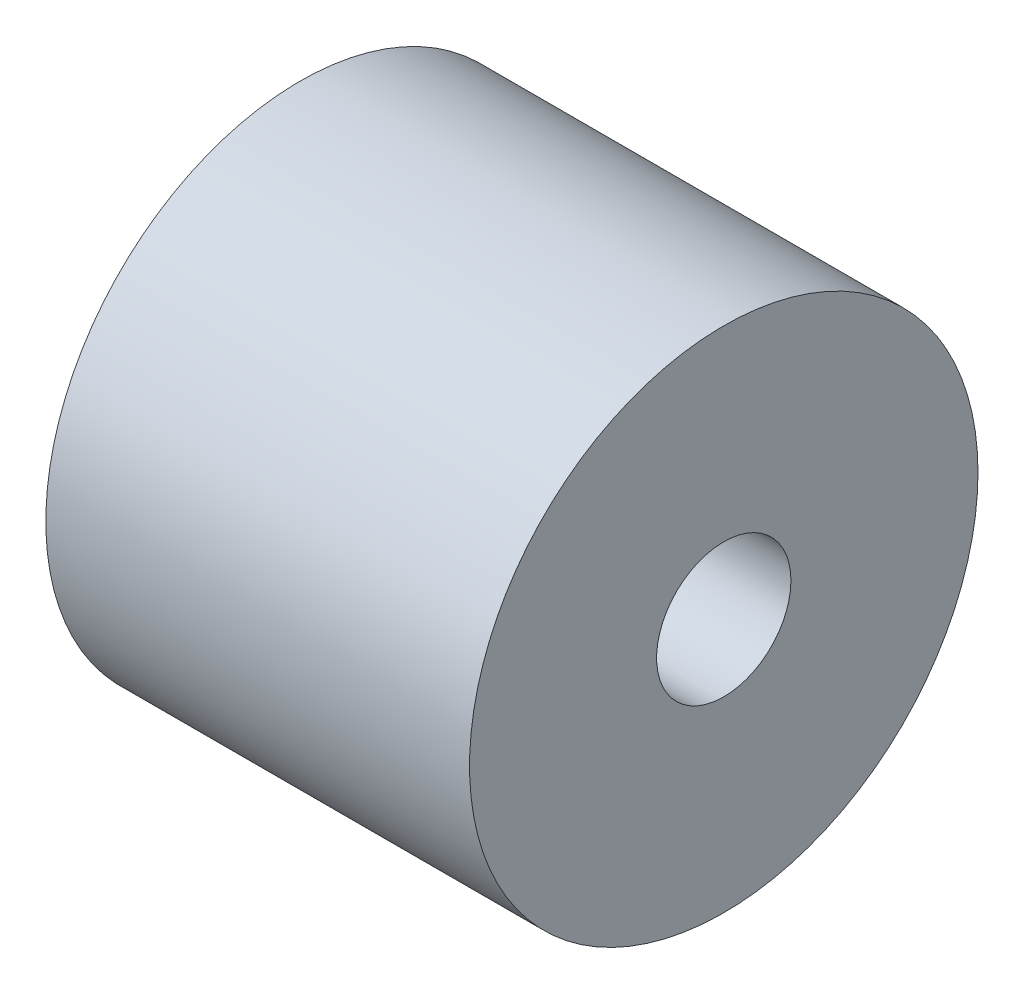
ISO-10303-21;
HEADER;
FILE_DESCRIPTION(('STEP AP214'),'2;1');
FILE_NAME('part.step','',(''),(''),'','','');
FILE_SCHEMA(('AUTOMOTIVE_DESIGN { 1 0 10303 214 1 1 1 1 }'));
ENDSEC;
DATA;
#1=APPLICATION_CONTEXT('core data for automotive mechanical design processes');
#2=APPLICATION_PROTOCOL_DEFINITION('international standard','automotive_design',2000,#1);
#3=PRODUCT_CONTEXT('',#1,'mechanical');
#4=PRODUCT('Part','Part','',(#3));
#5=PRODUCT_RELATED_PRODUCT_CATEGORY('part','',(#4));
#6=PRODUCT_DEFINITION_FORMATION('','',#4);
#7=PRODUCT_DEFINITION_CONTEXT('part definition',#1,'design');
#8=PRODUCT_DEFINITION('design','',#6,#7);
#9=PRODUCT_DEFINITION_SHAPE('','',#8);
#10=(LENGTH_UNIT() NAMED_UNIT(*) SI_UNIT(.MILLI.,.METRE.));
#11=(NAMED_UNIT(*) PLANE_ANGLE_UNIT() SI_UNIT($,.RADIAN.));
#12=(NAMED_UNIT(*) SI_UNIT($,.STERADIAN.) SOLID_ANGLE_UNIT());
#13=UNCERTAINTY_MEASURE_WITH_UNIT(LENGTH_MEASURE(1.E-05),#10,'distance_accuracy_value','');
#14=(GEOMETRIC_REPRESENTATION_CONTEXT(3) GLOBAL_UNCERTAINTY_ASSIGNED_CONTEXT((#13)) GLOBAL_UNIT_ASSIGNED_CONTEXT((#10,
#11,#12)) REPRESENTATION_CONTEXT('',''));
#15=CARTESIAN_POINT('',(0.,0.,0.));
#16=DIRECTION('',(0.,0.,1.));
#17=DIRECTION('',(1.,0.,0.));
#18=AXIS2_PLACEMENT_3D('',#15,#16,#17);
#19=CARTESIAN_POINT('',(5.,0.,0.));
#20=DIRECTION('',(1.,0.,0.));
#21=DIRECTION('',(0.,0.,-1.));
#22=AXIS2_PLACEMENT_3D('',#19,#20,#21);
#23=PLANE('',#22);
#24=CARTESIAN_POINT('',(5.,0.,0.));
#25=DIRECTION('',(1.,0.,0.));
#26=DIRECTION('',(0.,0.,-1.));
#27=AXIS2_PLACEMENT_3D('',#24,#25,#26);
#28=CIRCLE('',#27,6.);
#29=CARTESIAN_POINT('',(5.,0.,-6.));
#30=VERTEX_POINT('',#29);
#31=EDGE_CURVE('E10',#30,#30,#28,.T.);
#32=ORIENTED_EDGE('',*,*,#31,.T.);
#33=EDGE_LOOP('',(#32));
#34=FACE_BOUND('',#33,.T.);
#35=CARTESIAN_POINT('',(5.,0.,0.));
#36=DIRECTION('',(1.,0.,0.));
#37=DIRECTION('',(0.,0.,-1.));
#38=AXIS2_PLACEMENT_3D('',#35,#36,#37);
#39=CIRCLE('',#38,1.585);
#40=CARTESIAN_POINT('',(5.,0.,-1.585));
#41=VERTEX_POINT('',#40);
#42=EDGE_CURVE('E42',#41,#41,#39,.T.);
#43=ORIENTED_EDGE('',*,*,#42,.F.);
#44=EDGE_LOOP('',(#43));
#45=FACE_BOUND('',#44,.T.);
#46=ADVANCED_FACE('F31',(#34,#45),#23,.T.);
#47=CARTESIAN_POINT('',(-5.,0.,0.));
#48=DIRECTION('',(1.,0.,0.));
#49=DIRECTION('',(0.,0.,-1.));
#50=AXIS2_PLACEMENT_3D('',#47,#48,#49);
#51=PLANE('',#50);
#52=CARTESIAN_POINT('',(-5.,0.,0.));
#53=DIRECTION('',(1.,0.,0.));
#54=DIRECTION('',(0.,0.,-1.));
#55=AXIS2_PLACEMENT_3D('',#52,#53,#54);
#56=CIRCLE('',#55,6.);
#57=CARTESIAN_POINT('',(-5.,0.,-6.));
#58=VERTEX_POINT('',#57);
#59=EDGE_CURVE('E35',#58,#58,#56,.T.);
#60=ORIENTED_EDGE('',*,*,#59,.F.);
#61=EDGE_LOOP('',(#60));
#62=FACE_BOUND('',#61,.T.);
#63=CARTESIAN_POINT('',(-5.,0.,0.));
#64=DIRECTION('',(1.,0.,0.));
#65=DIRECTION('',(0.,0.,-1.));
#66=AXIS2_PLACEMENT_3D('',#63,#64,#65);
#67=CIRCLE('',#66,1.585);
#68=CARTESIAN_POINT('',(-5.,0.,-1.585));
#69=VERTEX_POINT('',#68);
#70=EDGE_CURVE('E44',#69,#69,#67,.T.);
#71=ORIENTED_EDGE('',*,*,#70,.T.);
#72=EDGE_LOOP('',(#71));
#73=FACE_BOUND('',#72,.T.);
#74=ADVANCED_FACE('F54',(#62,#73),#51,.F.);
#75=CARTESIAN_POINT('',(5.,0.,0.));
#76=DIRECTION('',(-1.,0.,0.));
#77=DIRECTION('',(0.,0.,1.));
#78=AXIS2_PLACEMENT_3D('',#75,#76,#77);
#79=CYLINDRICAL_SURFACE('',#78,6.);
#80=ORIENTED_EDGE('',*,*,#31,.F.);
#81=EDGE_LOOP('',(#80));
#82=FACE_BOUND('',#81,.T.);
#83=ORIENTED_EDGE('',*,*,#59,.T.);
#84=EDGE_LOOP('',(#83));
#85=FACE_BOUND('',#84,.T.);
#86=ADVANCED_FACE('F33',(#82,#85),#79,.T.);
#87=CARTESIAN_POINT('',(5.,0.,0.));
#88=DIRECTION('',(-1.,0.,0.));
#89=DIRECTION('',(0.,0.,1.));
#90=AXIS2_PLACEMENT_3D('',#87,#88,#89);
#91=CYLINDRICAL_SURFACE('',#90,1.585);
#92=ORIENTED_EDGE('',*,*,#42,.T.);
#93=EDGE_LOOP('',(#92));
#94=FACE_BOUND('',#93,.T.);
#95=ORIENTED_EDGE('',*,*,#70,.F.);
#96=EDGE_LOOP('',(#95));
#97=FACE_BOUND('',#96,.T.);
#98=ADVANCED_FACE('F50',(#94,#97),#91,.F.);
#99=CLOSED_SHELL('',(#46,#74,#86,#98));
#100=MANIFOLD_SOLID_BREP('B2',#99);
#101=ADVANCED_BREP_SHAPE_REPRESENTATION('',(#18,#100),#14);
#102=SHAPE_DEFINITION_REPRESENTATION(#9,#101);
ENDSEC;
END-ISO-10303-21;
